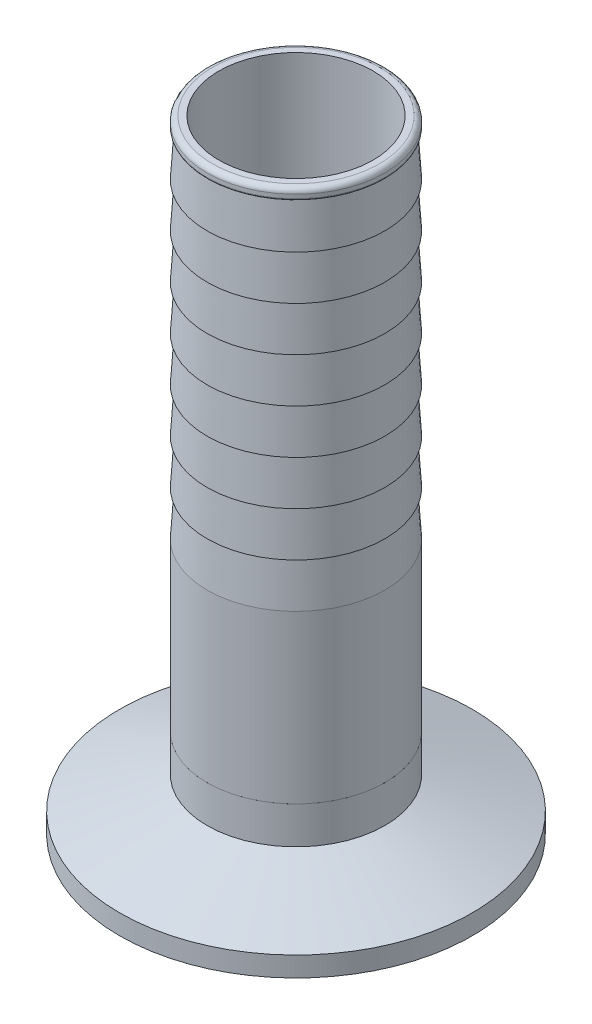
ISO-10303-21;
HEADER;
FILE_DESCRIPTION(('STEP AP214'),'2;1');
FILE_NAME('part.step','',(''),(''),'','','');
FILE_SCHEMA(('AUTOMOTIVE_DESIGN { 1 0 10303 214 1 1 1 1 }'));
ENDSEC;
DATA;
#1=APPLICATION_CONTEXT('core data for automotive mechanical design processes');
#2=APPLICATION_PROTOCOL_DEFINITION('international standard','automotive_design',2000,#1);
#3=PRODUCT_CONTEXT('',#1,'mechanical');
#4=PRODUCT('Part','Part','',(#3));
#5=PRODUCT_RELATED_PRODUCT_CATEGORY('part','',(#4));
#6=PRODUCT_DEFINITION_FORMATION('','',#4);
#7=PRODUCT_DEFINITION_CONTEXT('part definition',#1,'design');
#8=PRODUCT_DEFINITION('design','',#6,#7);
#9=PRODUCT_DEFINITION_SHAPE('','',#8);
#10=(LENGTH_UNIT() NAMED_UNIT(*) SI_UNIT(.MILLI.,.METRE.));
#11=(NAMED_UNIT(*) PLANE_ANGLE_UNIT() SI_UNIT($,.RADIAN.));
#12=(NAMED_UNIT(*) SI_UNIT($,.STERADIAN.) SOLID_ANGLE_UNIT());
#13=UNCERTAINTY_MEASURE_WITH_UNIT(LENGTH_MEASURE(1.E-05),#10,'distance_accuracy_value','');
#14=(GEOMETRIC_REPRESENTATION_CONTEXT(3) GLOBAL_UNCERTAINTY_ASSIGNED_CONTEXT((#13)) GLOBAL_UNIT_ASSIGNED_CONTEXT((#10,
#11,#12)) REPRESENTATION_CONTEXT('',''));
#15=CARTESIAN_POINT('',(0.,0.,0.));
#16=DIRECTION('',(0.,0.,1.));
#17=DIRECTION('',(1.,0.,0.));
#18=AXIS2_PLACEMENT_3D('',#15,#16,#17);
#19=CARTESIAN_POINT('',(36.2305462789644,30.890391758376,34.8496702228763));
#20=DIRECTION('',(0.,-1.,0.));
#21=DIRECTION('',(-0.475769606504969,0.,-0.879569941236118));
#22=AXIS2_PLACEMENT_3D('',#19,#20,#21);
#23=PLANE('',#22);
#24=CARTESIAN_POINT('',(25.0600080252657,30.890391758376,40.8919442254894));
#25=DIRECTION('',(0.,-1.,0.));
#26=DIRECTION('',(-0.475769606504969,0.,-0.879569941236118));
#27=AXIS2_PLACEMENT_3D('',#24,#25,#26);
#28=CIRCLE('',#27,11.0297020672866);
#29=CARTESIAN_POINT('',(19.8124110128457,30.890391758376,31.1905498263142));
#30=VERTEX_POINT('',#29);
#31=EDGE_CURVE('P0_E85',#30,#30,#28,.T.);
#32=ORIENTED_EDGE('',*,*,#31,.F.);
#33=EDGE_LOOP('',(#32));
#34=FACE_BOUND('',#33,.T.);
#35=CARTESIAN_POINT('',(25.0600080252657,30.890391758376,40.8919442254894));
#36=DIRECTION('',(0.,-1.,0.));
#37=DIRECTION('',(-0.475769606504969,0.,-0.879569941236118));
#38=AXIS2_PLACEMENT_3D('',#35,#36,#37);
#39=CIRCLE('',#38,12.7);
#40=CARTESIAN_POINT('',(19.0177340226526,30.890391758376,29.7214059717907));
#41=VERTEX_POINT('',#40);
#42=EDGE_CURVE('P0_E9',#41,#41,#39,.T.);
#43=ORIENTED_EDGE('',*,*,#42,.T.);
#44=EDGE_LOOP('',(#43));
#45=FACE_BOUND('',#44,.T.);
#46=ADVANCED_FACE('P0_F14',(#34,#45),#23,.T.);
#47=CARTESIAN_POINT('',(25.0600080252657,30.890391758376,40.8919442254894));
#48=DIRECTION('',(0.,-1.,0.));
#49=DIRECTION('',(-0.475769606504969,0.,-0.879569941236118));
#50=AXIS2_PLACEMENT_3D('',#47,#48,#49);
#51=CYLINDRICAL_SURFACE('',#50,12.7);
#52=CARTESIAN_POINT('',(25.0600080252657,54.715591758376,40.8919442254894));
#53=DIRECTION('',(0.,-1.,0.));
#54=DIRECTION('',(-0.475769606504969,0.,-0.879569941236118));
#55=AXIS2_PLACEMENT_3D('',#52,#53,#54);
#56=CIRCLE('',#55,12.7);
#57=CARTESIAN_POINT('',(19.0177340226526,54.715591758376,29.7214059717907));
#58=VERTEX_POINT('',#57);
#59=EDGE_CURVE('P0_E20',#58,#58,#56,.T.);
#60=ORIENTED_EDGE('',*,*,#59,.T.);
#61=EDGE_LOOP('',(#60));
#62=FACE_BOUND('',#61,.T.);
#63=ORIENTED_EDGE('',*,*,#42,.F.);
#64=EDGE_LOOP('',(#63));
#65=FACE_BOUND('',#64,.T.);
#66=ADVANCED_FACE('P0_F101',(#62,#65),#51,.T.);
#67=CARTESIAN_POINT('',(25.0600080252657,54.715591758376,40.8919442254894));
#68=DIRECTION('',(0.,-1.,0.));
#69=DIRECTION('',(-0.475769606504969,0.,-0.879569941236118));
#70=AXIS2_PLACEMENT_3D('',#67,#68,#69);
#71=CONICAL_SURFACE('',#70,12.7,0.0599281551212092);
#72=CARTESIAN_POINT('',(25.0600080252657,61.065591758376,40.8919442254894));
#73=DIRECTION('',(0.,-1.,0.));
#74=DIRECTION('',(-0.475769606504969,0.,-0.879569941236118));
#75=AXIS2_PLACEMENT_3D('',#72,#73,#74);
#76=CIRCLE('',#75,12.319);
#77=CARTESIAN_POINT('',(19.199002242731,61.065591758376,30.0565221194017));
#78=VERTEX_POINT('',#77);
#79=EDGE_CURVE('P0_E24',#78,#78,#76,.T.);
#80=ORIENTED_EDGE('',*,*,#79,.T.);
#81=EDGE_LOOP('',(#80));
#82=FACE_BOUND('',#81,.T.);
#83=ORIENTED_EDGE('',*,*,#59,.F.);
#84=EDGE_LOOP('',(#83));
#85=FACE_BOUND('',#84,.T.);
#86=ADVANCED_FACE('P0_F106',(#82,#85),#71,.T.);
#87=CARTESIAN_POINT('',(36.2305462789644,61.0655917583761,34.8496702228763));
#88=DIRECTION('',(0.,-1.,0.));
#89=DIRECTION('',(-0.475769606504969,0.,-0.879569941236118));
#90=AXIS2_PLACEMENT_3D('',#87,#88,#89);
#91=PLANE('',#90);
#92=CARTESIAN_POINT('',(25.0600080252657,61.065591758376,40.8919442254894));
#93=DIRECTION('',(0.,-1.,0.));
#94=DIRECTION('',(-0.475769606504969,0.,-0.879569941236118));
#95=AXIS2_PLACEMENT_3D('',#92,#93,#94);
#96=CIRCLE('',#95,12.7);
#97=CARTESIAN_POINT('',(19.0177340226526,61.065591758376,29.7214059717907));
#98=VERTEX_POINT('',#97);
#99=EDGE_CURVE('P0_E28',#98,#98,#96,.T.);
#100=ORIENTED_EDGE('',*,*,#99,.T.);
#101=EDGE_LOOP('',(#100));
#102=FACE_BOUND('',#101,.T.);
#103=ORIENTED_EDGE('',*,*,#79,.F.);
#104=EDGE_LOOP('',(#103));
#105=FACE_BOUND('',#104,.T.);
#106=ADVANCED_FACE('P0_F110',(#102,#105),#91,.T.);
#107=CARTESIAN_POINT('',(25.0600080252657,61.065591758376,40.8919442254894));
#108=DIRECTION('',(0.,-1.,0.));
#109=DIRECTION('',(-0.475769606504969,0.,-0.879569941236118));
#110=AXIS2_PLACEMENT_3D('',#107,#108,#109);
#111=CONICAL_SURFACE('',#110,12.7,0.0599281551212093);
#112=CARTESIAN_POINT('',(25.0600080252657,67.415591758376,40.8919442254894));
#113=DIRECTION('',(0.,-1.,0.));
#114=DIRECTION('',(-0.475769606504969,0.,-0.879569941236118));
#115=AXIS2_PLACEMENT_3D('',#112,#113,#114);
#116=CIRCLE('',#115,12.319);
#117=CARTESIAN_POINT('',(19.199002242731,67.415591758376,30.0565221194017));
#118=VERTEX_POINT('',#117);
#119=EDGE_CURVE('P0_E33',#118,#118,#116,.T.);
#120=ORIENTED_EDGE('',*,*,#119,.T.);
#121=EDGE_LOOP('',(#120));
#122=FACE_BOUND('',#121,.T.);
#123=ORIENTED_EDGE('',*,*,#99,.F.);
#124=EDGE_LOOP('',(#123));
#125=FACE_BOUND('',#124,.T.);
#126=ADVANCED_FACE('P0_F117',(#122,#125),#111,.T.);
#127=CARTESIAN_POINT('',(36.2305462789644,67.4155917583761,34.8496702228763));
#128=DIRECTION('',(0.,-1.,0.));
#129=DIRECTION('',(-0.475769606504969,0.,-0.879569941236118));
#130=AXIS2_PLACEMENT_3D('',#127,#128,#129);
#131=PLANE('',#130);
#132=CARTESIAN_POINT('',(25.0600080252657,67.415591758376,40.8919442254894));
#133=DIRECTION('',(0.,-1.,0.));
#134=DIRECTION('',(-0.475769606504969,0.,-0.879569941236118));
#135=AXIS2_PLACEMENT_3D('',#132,#133,#134);
#136=CIRCLE('',#135,12.7);
#137=CARTESIAN_POINT('',(19.0177340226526,67.415591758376,29.7214059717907));
#138=VERTEX_POINT('',#137);
#139=EDGE_CURVE('P0_E36',#138,#138,#136,.T.);
#140=ORIENTED_EDGE('',*,*,#139,.T.);
#141=EDGE_LOOP('',(#140));
#142=FACE_BOUND('',#141,.T.);
#143=ORIENTED_EDGE('',*,*,#119,.F.);
#144=EDGE_LOOP('',(#143));
#145=FACE_BOUND('',#144,.T.);
#146=ADVANCED_FACE('P0_F121',(#142,#145),#131,.T.);
#147=CARTESIAN_POINT('',(25.0600080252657,67.415591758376,40.8919442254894));
#148=DIRECTION('',(0.,-1.,0.));
#149=DIRECTION('',(-0.475769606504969,0.,-0.879569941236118));
#150=AXIS2_PLACEMENT_3D('',#147,#148,#149);
#151=CONICAL_SURFACE('',#150,12.7,0.0599281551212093);
#152=CARTESIAN_POINT('',(25.0600080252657,73.765591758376,40.8919442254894));
#153=DIRECTION('',(0.,-1.,0.));
#154=DIRECTION('',(-0.475769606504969,0.,-0.879569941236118));
#155=AXIS2_PLACEMENT_3D('',#152,#153,#154);
#156=CIRCLE('',#155,12.319);
#157=CARTESIAN_POINT('',(19.199002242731,73.765591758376,30.0565221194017));
#158=VERTEX_POINT('',#157);
#159=EDGE_CURVE('P0_E39',#158,#158,#156,.T.);
#160=ORIENTED_EDGE('',*,*,#159,.T.);
#161=EDGE_LOOP('',(#160));
#162=FACE_BOUND('',#161,.T.);
#163=ORIENTED_EDGE('',*,*,#139,.F.);
#164=EDGE_LOOP('',(#163));
#165=FACE_BOUND('',#164,.T.);
#166=ADVANCED_FACE('P0_F125',(#162,#165),#151,.T.);
#167=CARTESIAN_POINT('',(36.2305462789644,73.7655917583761,34.8496702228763));
#168=DIRECTION('',(0.,-1.,0.));
#169=DIRECTION('',(-0.475769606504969,0.,-0.879569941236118));
#170=AXIS2_PLACEMENT_3D('',#167,#168,#169);
#171=PLANE('',#170);
#172=CARTESIAN_POINT('',(25.0600080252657,73.765591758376,40.8919442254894));
#173=DIRECTION('',(0.,-1.,0.));
#174=DIRECTION('',(-0.475769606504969,0.,-0.879569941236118));
#175=AXIS2_PLACEMENT_3D('',#172,#173,#174);
#176=CIRCLE('',#175,12.7);
#177=CARTESIAN_POINT('',(19.0177340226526,73.765591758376,29.7214059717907));
#178=VERTEX_POINT('',#177);
#179=EDGE_CURVE('P0_E42',#178,#178,#176,.T.);
#180=ORIENTED_EDGE('',*,*,#179,.T.);
#181=EDGE_LOOP('',(#180));
#182=FACE_BOUND('',#181,.T.);
#183=ORIENTED_EDGE('',*,*,#159,.F.);
#184=EDGE_LOOP('',(#183));
#185=FACE_BOUND('',#184,.T.);
#186=ADVANCED_FACE('P0_F129',(#182,#185),#171,.T.);
#187=CARTESIAN_POINT('',(25.0600080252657,73.765591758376,40.8919442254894));
#188=DIRECTION('',(0.,-1.,0.));
#189=DIRECTION('',(-0.475769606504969,0.,-0.879569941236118));
#190=AXIS2_PLACEMENT_3D('',#187,#188,#189);
#191=CONICAL_SURFACE('',#190,12.7,0.0599281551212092);
#192=CARTESIAN_POINT('',(25.0600080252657,80.115591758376,40.8919442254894));
#193=DIRECTION('',(0.,-1.,0.));
#194=DIRECTION('',(-0.475769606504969,0.,-0.879569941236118));
#195=AXIS2_PLACEMENT_3D('',#192,#193,#194);
#196=CIRCLE('',#195,12.319);
#197=CARTESIAN_POINT('',(19.199002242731,80.115591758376,30.0565221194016));
#198=VERTEX_POINT('',#197);
#199=EDGE_CURVE('P0_E45',#198,#198,#196,.T.);
#200=ORIENTED_EDGE('',*,*,#199,.T.);
#201=EDGE_LOOP('',(#200));
#202=FACE_BOUND('',#201,.T.);
#203=ORIENTED_EDGE('',*,*,#179,.F.);
#204=EDGE_LOOP('',(#203));
#205=FACE_BOUND('',#204,.T.);
#206=ADVANCED_FACE('P0_F133',(#202,#205),#191,.T.);
#207=CARTESIAN_POINT('',(36.2305462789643,80.1155917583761,34.8496702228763));
#208=DIRECTION('',(0.,-1.,0.));
#209=DIRECTION('',(-0.475769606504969,0.,-0.879569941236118));
#210=AXIS2_PLACEMENT_3D('',#207,#208,#209);
#211=PLANE('',#210);
#212=CARTESIAN_POINT('',(25.0600080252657,80.115591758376,40.8919442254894));
#213=DIRECTION('',(0.,-1.,0.));
#214=DIRECTION('',(-0.475769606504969,0.,-0.879569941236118));
#215=AXIS2_PLACEMENT_3D('',#212,#213,#214);
#216=CIRCLE('',#215,12.7);
#217=CARTESIAN_POINT('',(19.0177340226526,80.115591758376,29.7214059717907));
#218=VERTEX_POINT('',#217);
#219=EDGE_CURVE('P0_E48',#218,#218,#216,.T.);
#220=ORIENTED_EDGE('',*,*,#219,.T.);
#221=EDGE_LOOP('',(#220));
#222=FACE_BOUND('',#221,.T.);
#223=ORIENTED_EDGE('',*,*,#199,.F.);
#224=EDGE_LOOP('',(#223));
#225=FACE_BOUND('',#224,.T.);
#226=ADVANCED_FACE('P0_F137',(#222,#225),#211,.T.);
#227=CARTESIAN_POINT('',(25.0600080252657,80.115591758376,40.8919442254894));
#228=DIRECTION('',(0.,-1.,0.));
#229=DIRECTION('',(-0.475769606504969,0.,-0.879569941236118));
#230=AXIS2_PLACEMENT_3D('',#227,#228,#229);
#231=CONICAL_SURFACE('',#230,12.7,0.0599281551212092);
#232=CARTESIAN_POINT('',(25.0600080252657,86.465591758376,40.8919442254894));
#233=DIRECTION('',(0.,-1.,0.));
#234=DIRECTION('',(-0.475769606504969,0.,-0.879569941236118));
#235=AXIS2_PLACEMENT_3D('',#232,#233,#234);
#236=CIRCLE('',#235,12.319);
#237=CARTESIAN_POINT('',(19.199002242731,86.465591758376,30.0565221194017));
#238=VERTEX_POINT('',#237);
#239=EDGE_CURVE('P0_E51',#238,#238,#236,.T.);
#240=ORIENTED_EDGE('',*,*,#239,.T.);
#241=EDGE_LOOP('',(#240));
#242=FACE_BOUND('',#241,.T.);
#243=ORIENTED_EDGE('',*,*,#219,.F.);
#244=EDGE_LOOP('',(#243));
#245=FACE_BOUND('',#244,.T.);
#246=ADVANCED_FACE('P0_F141',(#242,#245),#231,.T.);
#247=CARTESIAN_POINT('',(36.2305462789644,86.4655917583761,34.8496702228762));
#248=DIRECTION('',(0.,-1.,0.));
#249=DIRECTION('',(-0.475769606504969,0.,-0.879569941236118));
#250=AXIS2_PLACEMENT_3D('',#247,#248,#249);
#251=PLANE('',#250);
#252=CARTESIAN_POINT('',(25.0600080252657,86.465591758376,40.8919442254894));
#253=DIRECTION('',(0.,-1.,0.));
#254=DIRECTION('',(-0.475769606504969,0.,-0.879569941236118));
#255=AXIS2_PLACEMENT_3D('',#252,#253,#254);
#256=CIRCLE('',#255,12.7);
#257=CARTESIAN_POINT('',(19.0177340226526,86.465591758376,29.7214059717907));
#258=VERTEX_POINT('',#257);
#259=EDGE_CURVE('P0_E54',#258,#258,#256,.T.);
#260=ORIENTED_EDGE('',*,*,#259,.T.);
#261=EDGE_LOOP('',(#260));
#262=FACE_BOUND('',#261,.T.);
#263=ORIENTED_EDGE('',*,*,#239,.F.);
#264=EDGE_LOOP('',(#263));
#265=FACE_BOUND('',#264,.T.);
#266=ADVANCED_FACE('P0_F145',(#262,#265),#251,.T.);
#267=CARTESIAN_POINT('',(25.0600080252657,86.465591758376,40.8919442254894));
#268=DIRECTION('',(0.,-1.,0.));
#269=DIRECTION('',(-0.475769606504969,0.,-0.879569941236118));
#270=AXIS2_PLACEMENT_3D('',#267,#268,#269);
#271=CONICAL_SURFACE('',#270,12.7,0.0599281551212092);
#272=CARTESIAN_POINT('',(25.0600080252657,92.815591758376,40.8919442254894));
#273=DIRECTION('',(0.,-1.,0.));
#274=DIRECTION('',(-0.475769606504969,0.,-0.879569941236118));
#275=AXIS2_PLACEMENT_3D('',#272,#273,#274);
#276=CIRCLE('',#275,12.319);
#277=CARTESIAN_POINT('',(19.199002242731,92.815591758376,30.0565221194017));
#278=VERTEX_POINT('',#277);
#279=EDGE_CURVE('P0_E57',#278,#278,#276,.T.);
#280=ORIENTED_EDGE('',*,*,#279,.T.);
#281=EDGE_LOOP('',(#280));
#282=FACE_BOUND('',#281,.T.);
#283=ORIENTED_EDGE('',*,*,#259,.F.);
#284=EDGE_LOOP('',(#283));
#285=FACE_BOUND('',#284,.T.);
#286=ADVANCED_FACE('P0_F149',(#282,#285),#271,.T.);
#287=CARTESIAN_POINT('',(36.2305462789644,92.8155917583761,34.8496702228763));
#288=DIRECTION('',(0.,-1.,0.));
#289=DIRECTION('',(-0.475769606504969,0.,-0.879569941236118));
#290=AXIS2_PLACEMENT_3D('',#287,#288,#289);
#291=PLANE('',#290);
#292=CARTESIAN_POINT('',(25.0600080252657,92.815591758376,40.8919442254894));
#293=DIRECTION('',(0.,-1.,0.));
#294=DIRECTION('',(-0.475769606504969,0.,-0.879569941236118));
#295=AXIS2_PLACEMENT_3D('',#292,#293,#294);
#296=CIRCLE('',#295,12.7);
#297=CARTESIAN_POINT('',(19.0177340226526,92.815591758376,29.7214059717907));
#298=VERTEX_POINT('',#297);
#299=EDGE_CURVE('P0_E60',#298,#298,#296,.T.);
#300=ORIENTED_EDGE('',*,*,#299,.T.);
#301=EDGE_LOOP('',(#300));
#302=FACE_BOUND('',#301,.T.);
#303=ORIENTED_EDGE('',*,*,#279,.F.);
#304=EDGE_LOOP('',(#303));
#305=FACE_BOUND('',#304,.T.);
#306=ADVANCED_FACE('P0_F153',(#302,#305),#291,.T.);
#307=CARTESIAN_POINT('',(25.0600080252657,92.815591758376,40.8919442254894));
#308=DIRECTION('',(0.,-1.,0.));
#309=DIRECTION('',(-0.475769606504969,0.,-0.879569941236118));
#310=AXIS2_PLACEMENT_3D('',#307,#308,#309);
#311=CONICAL_SURFACE('',#310,12.7,0.0599281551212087);
#312=CARTESIAN_POINT('',(25.0600080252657,99.165591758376,40.8919442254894));
#313=DIRECTION('',(0.,-1.,0.));
#314=DIRECTION('',(-0.475769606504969,0.,-0.879569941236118));
#315=AXIS2_PLACEMENT_3D('',#312,#313,#314);
#316=CIRCLE('',#315,12.319);
#317=CARTESIAN_POINT('',(19.199002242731,99.165591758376,30.0565221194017));
#318=VERTEX_POINT('',#317);
#319=EDGE_CURVE('P0_E63',#318,#318,#316,.T.);
#320=ORIENTED_EDGE('',*,*,#319,.T.);
#321=EDGE_LOOP('',(#320));
#322=FACE_BOUND('',#321,.T.);
#323=ORIENTED_EDGE('',*,*,#299,.F.);
#324=EDGE_LOOP('',(#323));
#325=FACE_BOUND('',#324,.T.);
#326=ADVANCED_FACE('P0_F157',(#322,#325),#311,.T.);
#327=CARTESIAN_POINT('',(36.2305462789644,99.165591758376,34.8496702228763));
#328=DIRECTION('',(0.,-1.,0.));
#329=DIRECTION('',(-0.475769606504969,0.,-0.879569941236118));
#330=AXIS2_PLACEMENT_3D('',#327,#328,#329);
#331=PLANE('',#330);
#332=CARTESIAN_POINT('',(25.0600080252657,99.165591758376,40.8919442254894));
#333=DIRECTION('',(0.,-1.,0.));
#334=DIRECTION('',(-0.475769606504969,0.,-0.879569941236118));
#335=AXIS2_PLACEMENT_3D('',#332,#333,#334);
#336=CIRCLE('',#335,12.7);
#337=CARTESIAN_POINT('',(19.0177340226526,99.165591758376,29.7214059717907));
#338=VERTEX_POINT('',#337);
#339=EDGE_CURVE('P0_E66',#338,#338,#336,.T.);
#340=ORIENTED_EDGE('',*,*,#339,.T.);
#341=EDGE_LOOP('',(#340));
#342=FACE_BOUND('',#341,.T.);
#343=ORIENTED_EDGE('',*,*,#319,.F.);
#344=EDGE_LOOP('',(#343));
#345=FACE_BOUND('',#344,.T.);
#346=ADVANCED_FACE('P0_F161',(#342,#345),#331,.T.);
#347=CARTESIAN_POINT('',(25.0600080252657,99.165591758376,40.8919442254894));
#348=DIRECTION('',(0.,-1.,0.));
#349=DIRECTION('',(-0.475769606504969,0.,-0.879569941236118));
#350=AXIS2_PLACEMENT_3D('',#347,#348,#349);
#351=CONICAL_SURFACE('',#350,12.7,0.0599281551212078);
#352=CARTESIAN_POINT('',(25.0600080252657,105.515591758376,40.8919442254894));
#353=DIRECTION('',(0.,-1.,0.));
#354=DIRECTION('',(-0.475769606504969,0.,-0.879569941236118));
#355=AXIS2_PLACEMENT_3D('',#352,#353,#354);
#356=CIRCLE('',#355,12.319);
#357=CARTESIAN_POINT('',(19.199002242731,105.515591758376,30.0565221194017));
#358=VERTEX_POINT('',#357);
#359=EDGE_CURVE('P0_E69',#358,#358,#356,.T.);
#360=ORIENTED_EDGE('',*,*,#359,.T.);
#361=EDGE_LOOP('',(#360));
#362=FACE_BOUND('',#361,.T.);
#363=ORIENTED_EDGE('',*,*,#339,.F.);
#364=EDGE_LOOP('',(#363));
#365=FACE_BOUND('',#364,.T.);
#366=ADVANCED_FACE('P0_F165',(#362,#365),#351,.T.);
#367=CARTESIAN_POINT('',(36.0071355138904,105.515591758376,34.9705157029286));
#368=DIRECTION('',(0.,-1.,0.));
#369=DIRECTION('',(-0.475769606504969,0.,-0.879569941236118));
#370=AXIS2_PLACEMENT_3D('',#367,#368,#369);
#371=PLANE('',#370);
#372=CARTESIAN_POINT('',(25.0600080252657,105.515591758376,40.8919442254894));
#373=DIRECTION('',(0.,-1.,0.));
#374=DIRECTION('',(-0.475769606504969,0.,-0.879569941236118));
#375=AXIS2_PLACEMENT_3D('',#372,#373,#374);
#376=CIRCLE('',#375,12.446);
#377=CARTESIAN_POINT('',(19.1385795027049,105.515591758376,29.9448167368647));
#378=VERTEX_POINT('',#377);
#379=EDGE_CURVE('P0_E72',#378,#378,#376,.T.);
#380=ORIENTED_EDGE('',*,*,#379,.T.);
#381=EDGE_LOOP('',(#380));
#382=FACE_BOUND('',#381,.T.);
#383=ORIENTED_EDGE('',*,*,#359,.F.);
#384=EDGE_LOOP('',(#383));
#385=FACE_BOUND('',#384,.T.);
#386=ADVANCED_FACE('P0_F169',(#382,#385),#371,.T.);
#387=CARTESIAN_POINT('',(25.0600080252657,105.769591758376,40.8919442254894));
#388=DIRECTION('',(0.,-1.,0.));
#389=DIRECTION('',(-0.475769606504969,0.,-0.879569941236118));
#390=AXIS2_PLACEMENT_3D('',#387,#388,#389);
#391=TOROIDAL_SURFACE('',#390,12.446,0.254000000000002);
#392=CARTESIAN_POINT('',(25.0600080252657,105.769591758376,40.8919442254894));
#393=DIRECTION('',(0.,-1.,0.));
#394=DIRECTION('',(-0.475769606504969,0.,-0.879569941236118));
#395=AXIS2_PLACEMENT_3D('',#392,#393,#394);
#396=CIRCLE('',#395,12.7);
#397=CARTESIAN_POINT('',(19.0177340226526,105.769591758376,29.7214059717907));
#398=VERTEX_POINT('',#397);
#399=EDGE_CURVE('P0_E75',#398,#398,#396,.T.);
#400=ORIENTED_EDGE('',*,*,#399,.T.);
#401=EDGE_LOOP('',(#400));
#402=FACE_BOUND('',#401,.T.);
#403=ORIENTED_EDGE('',*,*,#379,.F.);
#404=EDGE_LOOP('',(#403));
#405=FACE_BOUND('',#404,.T.);
#406=ADVANCED_FACE('P0_F173',(#402,#405),#391,.T.);
#407=CARTESIAN_POINT('',(25.0600080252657,30.890391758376,40.8919442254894));
#408=DIRECTION('',(0.,-1.,0.));
#409=DIRECTION('',(-0.475769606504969,0.,-0.879569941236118));
#410=AXIS2_PLACEMENT_3D('',#407,#408,#409);
#411=CYLINDRICAL_SURFACE('',#410,12.7);
#412=CARTESIAN_POINT('',(25.0600080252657,106.328391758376,40.8919442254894));
#413=DIRECTION('',(0.,-1.,0.));
#414=DIRECTION('',(-0.475769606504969,0.,-0.879569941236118));
#415=AXIS2_PLACEMENT_3D('',#412,#413,#414);
#416=CIRCLE('',#415,12.7);
#417=CARTESIAN_POINT('',(19.0177340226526,106.328391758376,29.7214059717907));
#418=VERTEX_POINT('',#417);
#419=EDGE_CURVE('P0_E78',#418,#418,#416,.T.);
#420=ORIENTED_EDGE('',*,*,#419,.T.);
#421=EDGE_LOOP('',(#420));
#422=FACE_BOUND('',#421,.T.);
#423=ORIENTED_EDGE('',*,*,#399,.F.);
#424=EDGE_LOOP('',(#423));
#425=FACE_BOUND('',#424,.T.);
#426=ADVANCED_FACE('P0_F177',(#422,#425),#411,.T.);
#427=CARTESIAN_POINT('',(25.0600080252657,106.328391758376,40.8919442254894));
#428=DIRECTION('',(0.,-1.,0.));
#429=DIRECTION('',(-0.475769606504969,0.,-0.879569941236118));
#430=AXIS2_PLACEMENT_3D('',#427,#428,#429);
#431=TOROIDAL_SURFACE('',#430,11.938,0.762);
#432=CARTESIAN_POINT('',(25.0600080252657,107.090391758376,40.8919442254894));
#433=DIRECTION('',(0.,-1.,0.));
#434=DIRECTION('',(-0.475769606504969,0.,-0.879569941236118));
#435=AXIS2_PLACEMENT_3D('',#432,#433,#434);
#436=CIRCLE('',#435,11.938);
#437=CARTESIAN_POINT('',(19.3802704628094,107.090391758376,30.3916382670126));
#438=VERTEX_POINT('',#437);
#439=EDGE_CURVE('P0_E81',#438,#438,#436,.T.);
#440=ORIENTED_EDGE('',*,*,#439,.T.);
#441=EDGE_LOOP('',(#440));
#442=FACE_BOUND('',#441,.T.);
#443=ORIENTED_EDGE('',*,*,#419,.F.);
#444=EDGE_LOOP('',(#443));
#445=FACE_BOUND('',#444,.T.);
#446=ADVANCED_FACE('P0_F181',(#442,#445),#431,.T.);
#447=CARTESIAN_POINT('',(25.0600080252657,107.090391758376,40.8919442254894));
#448=DIRECTION('',(0.,1.,0.));
#449=DIRECTION('',(0.475769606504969,0.,0.879569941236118));
#450=AXIS2_PLACEMENT_3D('',#447,#448,#449);
#451=PLANE('',#450);
#452=CARTESIAN_POINT('',(25.0600080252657,107.090391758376,40.8919442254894));
#453=DIRECTION('',(0.,-1.,0.));
#454=DIRECTION('',(-0.475769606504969,0.,-0.879569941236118));
#455=AXIS2_PLACEMENT_3D('',#452,#453,#454);
#456=CIRCLE('',#455,11.0297020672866);
#457=CARTESIAN_POINT('',(19.8124110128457,107.090391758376,31.1905498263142));
#458=VERTEX_POINT('',#457);
#459=EDGE_CURVE('P0_E84',#458,#458,#456,.T.);
#460=ORIENTED_EDGE('',*,*,#459,.T.);
#461=EDGE_LOOP('',(#460));
#462=FACE_BOUND('',#461,.T.);
#463=ORIENTED_EDGE('',*,*,#439,.F.);
#464=EDGE_LOOP('',(#463));
#465=FACE_BOUND('',#464,.T.);
#466=ADVANCED_FACE('P0_F91',(#462,#465),#451,.T.);
#467=CARTESIAN_POINT('',(25.0600080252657,107.090391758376,40.8919442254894));
#468=DIRECTION('',(0.,-1.,0.));
#469=DIRECTION('',(-0.475769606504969,0.,-0.879569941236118));
#470=AXIS2_PLACEMENT_3D('',#467,#468,#469);
#471=CYLINDRICAL_SURFACE('',#470,11.0297020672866);
#472=CARTESIAN_POINT('',(19.8124110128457,107.090391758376,31.1905498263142));
#473=CARTESIAN_POINT('',(19.8124110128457,106.296641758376,31.1905498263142));
#474=CARTESIAN_POINT('',(19.8124110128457,105.502891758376,31.1905498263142));
#475=CARTESIAN_POINT('',(19.8124110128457,103.915391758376,31.1905498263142));
#476=CARTESIAN_POINT('',(19.8124110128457,103.121641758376,31.1905498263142));
#477=CARTESIAN_POINT('',(19.8124110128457,101.534141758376,31.1905498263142));
#478=CARTESIAN_POINT('',(19.8124110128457,100.740391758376,31.1905498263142));
#479=CARTESIAN_POINT('',(19.8124110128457,99.152891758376,31.1905498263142));
#480=CARTESIAN_POINT('',(19.8124110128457,98.359141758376,31.1905498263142));
#481=CARTESIAN_POINT('',(19.8124110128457,96.771641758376,31.1905498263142));
#482=CARTESIAN_POINT('',(19.8124110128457,95.977891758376,31.1905498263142));
#483=CARTESIAN_POINT('',(19.8124110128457,94.390391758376,31.1905498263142));
#484=CARTESIAN_POINT('',(19.8124110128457,93.596641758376,31.1905498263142));
#485=CARTESIAN_POINT('',(19.8124110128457,92.009141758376,31.1905498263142));
#486=CARTESIAN_POINT('',(19.8124110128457,91.215391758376,31.1905498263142));
#487=CARTESIAN_POINT('',(19.8124110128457,89.627891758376,31.1905498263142));
#488=CARTESIAN_POINT('',(19.8124110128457,88.834141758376,31.1905498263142));
#489=CARTESIAN_POINT('',(19.8124110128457,87.246641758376,31.1905498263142));
#490=CARTESIAN_POINT('',(19.8124110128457,86.452891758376,31.1905498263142));
#491=CARTESIAN_POINT('',(19.8124110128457,84.865391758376,31.1905498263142));
#492=CARTESIAN_POINT('',(19.8124110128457,84.071641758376,31.1905498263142));
#493=CARTESIAN_POINT('',(19.8124110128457,82.484141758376,31.1905498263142));
#494=CARTESIAN_POINT('',(19.8124110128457,81.690391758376,31.1905498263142));
#495=CARTESIAN_POINT('',(19.8124110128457,80.102891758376,31.1905498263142));
#496=CARTESIAN_POINT('',(19.8124110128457,79.309141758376,31.1905498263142));
#497=CARTESIAN_POINT('',(19.8124110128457,77.721641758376,31.1905498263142));
#498=CARTESIAN_POINT('',(19.8124110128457,76.927891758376,31.1905498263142));
#499=CARTESIAN_POINT('',(19.8124110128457,75.340391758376,31.1905498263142));
#500=CARTESIAN_POINT('',(19.8124110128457,74.546641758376,31.1905498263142));
#501=CARTESIAN_POINT('',(19.8124110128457,72.959141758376,31.1905498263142));
#502=CARTESIAN_POINT('',(19.8124110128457,72.165391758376,31.1905498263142));
#503=CARTESIAN_POINT('',(19.8124110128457,70.577891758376,31.1905498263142));
#504=CARTESIAN_POINT('',(19.8124110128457,69.784141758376,31.1905498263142));
#505=CARTESIAN_POINT('',(19.8124110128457,68.196641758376,31.1905498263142));
#506=CARTESIAN_POINT('',(19.8124110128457,67.402891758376,31.1905498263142));
#507=CARTESIAN_POINT('',(19.8124110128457,65.815391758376,31.1905498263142));
#508=CARTESIAN_POINT('',(19.8124110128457,65.021641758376,31.1905498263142));
#509=CARTESIAN_POINT('',(19.8124110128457,63.434141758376,31.1905498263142));
#510=CARTESIAN_POINT('',(19.8124110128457,62.640391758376,31.1905498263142));
#511=CARTESIAN_POINT('',(19.8124110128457,61.052891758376,31.1905498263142));
#512=CARTESIAN_POINT('',(19.8124110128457,60.259141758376,31.1905498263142));
#513=CARTESIAN_POINT('',(19.8124110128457,58.671641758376,31.1905498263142));
#514=CARTESIAN_POINT('',(19.8124110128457,57.877891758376,31.1905498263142));
#515=CARTESIAN_POINT('',(19.8124110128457,56.290391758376,31.1905498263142));
#516=CARTESIAN_POINT('',(19.8124110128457,55.496641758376,31.1905498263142));
#517=CARTESIAN_POINT('',(19.8124110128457,53.909141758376,31.1905498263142));
#518=CARTESIAN_POINT('',(19.8124110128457,53.115391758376,31.1905498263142));
#519=CARTESIAN_POINT('',(19.8124110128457,51.527891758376,31.1905498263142));
#520=CARTESIAN_POINT('',(19.8124110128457,50.734141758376,31.1905498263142));
#521=CARTESIAN_POINT('',(19.8124110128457,49.146641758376,31.1905498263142));
#522=CARTESIAN_POINT('',(19.8124110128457,48.352891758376,31.1905498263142));
#523=CARTESIAN_POINT('',(19.8124110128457,46.765391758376,31.1905498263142));
#524=CARTESIAN_POINT('',(19.8124110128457,45.971641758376,31.1905498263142));
#525=CARTESIAN_POINT('',(19.8124110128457,44.384141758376,31.1905498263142));
#526=CARTESIAN_POINT('',(19.8124110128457,43.5903917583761,31.1905498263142));
#527=CARTESIAN_POINT('',(19.8124110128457,42.0028917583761,31.1905498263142));
#528=CARTESIAN_POINT('',(19.8124110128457,41.2091417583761,31.1905498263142));
#529=CARTESIAN_POINT('',(19.8124110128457,39.6216417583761,31.1905498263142));
#530=CARTESIAN_POINT('',(19.8124110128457,38.8278917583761,31.1905498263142));
#531=CARTESIAN_POINT('',(19.8124110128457,37.240391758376,31.1905498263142));
#532=CARTESIAN_POINT('',(19.8124110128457,36.4466417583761,31.1905498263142));
#533=CARTESIAN_POINT('',(19.8124110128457,34.859141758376,31.1905498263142));
#534=CARTESIAN_POINT('',(19.8124110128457,34.0653917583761,31.1905498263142));
#535=CARTESIAN_POINT('',(19.8124110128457,32.477891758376,31.1905498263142));
#536=CARTESIAN_POINT('',(19.8124110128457,31.684141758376,31.1905498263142));
#537=CARTESIAN_POINT('',(19.8124110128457,30.890391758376,31.1905498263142));
#538=B_SPLINE_CURVE_WITH_KNOTS('',3,(#472,#473,#474,#475,#476,#477,#478,#479,#480,#481,#482,
#483,#484,#485,#486,#487,#488,#489,#490,#491,#492,#493,#494,#495,#496,#497,#498,#499,#500,#501,
#502,#503,#504,#505,#506,#507,#508,#509,#510,#511,#512,#513,#514,#515,#516,#517,#518,#519,#520,
#521,#522,#523,#524,#525,#526,#527,#528,#529,#530,#531,#532,#533,#534,#535,#536,#537),
.UNSPECIFIED.,.F.,.F.,(4,2,2,2,2,2,2,2,2,2,2,2,2,2,2,2,2,2,2,2,2,2,2,2,2,2,2,2,2,2,2,2,4),(0.,
2.38125,4.7625,7.14375,9.52500000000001,11.90625,14.2875,16.66875,19.05,21.43125,23.8125,
26.19375,28.575,30.95625,33.3375,35.71875,38.1,40.48125,42.8625,45.24375,47.625,50.00625,
52.3875,54.76875,57.15,59.53125,61.9125,64.29375,66.675,69.05625,71.4375,73.81875,76.2),.UNSPECIFIED.);
#539=EDGE_CURVE('P0_BSEAM94',#458,#30,#538,.T.);
#540=ORIENTED_EDGE('',*,*,#459,.F.);
#541=ORIENTED_EDGE('',*,*,#31,.T.);
#542=ORIENTED_EDGE('',*,*,#539,.T.);
#543=ORIENTED_EDGE('',*,*,#539,.F.);
#544=EDGE_LOOP('',(#540,#542,#541,#543));
#545=FACE_BOUND('',#544,.T.);
#546=ADVANCED_FACE('P0_F94',(#545),#471,.F.);
#547=CLOSED_SHELL('',(#46,#66,#86,#106,#126,#146,#166,#186,#206,#226,#246,#266,#286,#306,#326,
#346,#366,#386,#406,#426,#446,#466,#546));
#548=MANIFOLD_SOLID_BREP('P0_B1',#547);
#549=CARTESIAN_POINT('',(25.0600080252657,18.977791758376,40.8919442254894));
#550=DIRECTION('',(0.,-1.,0.));
#551=DIRECTION('',(0.,0.,-1.));
#552=AXIS2_PLACEMENT_3D('',#549,#550,#551);
#553=TOROIDAL_SURFACE('',#552,23.6366084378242,0.787399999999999);
#554=CARTESIAN_POINT('',(25.0600080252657,18.190391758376,40.8919442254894));
#555=DIRECTION('',(0.,-1.,0.));
#556=DIRECTION('',(0.,0.,-1.));
#557=AXIS2_PLACEMENT_3D('',#554,#555,#556);
#558=CIRCLE('',#557,23.6366084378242);
#559=CARTESIAN_POINT('',(25.0600080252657,18.190391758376,17.2553357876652));
#560=VERTEX_POINT('',#559);
#561=EDGE_CURVE('P1_E49',#560,#560,#558,.T.);
#562=ORIENTED_EDGE('',*,*,#561,.T.);
#563=EDGE_LOOP('',(#562));
#564=FACE_BOUND('',#563,.T.);
#565=CARTESIAN_POINT('',(25.0600080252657,18.664850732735,40.8919442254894));
#566=DIRECTION('',(0.,-1.,0.));
#567=DIRECTION('',(0.,0.,-1.));
#568=AXIS2_PLACEMENT_3D('',#565,#566,#567);
#569=CIRCLE('',#568,22.9140666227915);
#570=CARTESIAN_POINT('',(25.0600080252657,18.664850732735,17.9778776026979));
#571=VERTEX_POINT('',#570);
#572=EDGE_CURVE('P1_E10',#571,#571,#569,.T.);
#573=ORIENTED_EDGE('',*,*,#572,.F.);
#574=EDGE_LOOP('',(#573));
#575=FACE_BOUND('',#574,.T.);
#576=ADVANCED_FACE('P1_F15',(#564,#575),#553,.T.);
#577=CARTESIAN_POINT('',(25.0600080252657,18.190391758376,40.8919442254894));
#578=DIRECTION('',(0.,-1.,0.));
#579=DIRECTION('',(0.,0.,-1.));
#580=AXIS2_PLACEMENT_3D('',#577,#578,#579);
#581=TOROIDAL_SURFACE('',#580,21.8186,1.1938);
#582=CARTESIAN_POINT('',(25.0600080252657,18.664850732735,40.8919442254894));
#583=DIRECTION('',(0.,-1.,0.));
#584=DIRECTION('',(0.,0.,-1.));
#585=AXIS2_PLACEMENT_3D('',#582,#583,#584);
#586=CIRCLE('',#585,20.7231333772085);
#587=CARTESIAN_POINT('',(25.0600080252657,18.664850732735,20.1688108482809));
#588=VERTEX_POINT('',#587);
#589=EDGE_CURVE('P1_E21',#588,#588,#586,.T.);
#590=ORIENTED_EDGE('',*,*,#589,.F.);
#591=EDGE_LOOP('',(#590));
#592=FACE_BOUND('',#591,.T.);
#593=ORIENTED_EDGE('',*,*,#572,.T.);
#594=EDGE_LOOP('',(#593));
#595=FACE_BOUND('',#594,.T.);
#596=ADVANCED_FACE('P1_F98',(#592,#595),#581,.F.);
#597=CARTESIAN_POINT('',(25.0600080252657,18.977791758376,40.8919442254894));
#598=DIRECTION('',(0.,-1.,0.));
#599=DIRECTION('',(0.,0.,-1.));
#600=AXIS2_PLACEMENT_3D('',#597,#598,#599);
#601=TOROIDAL_SURFACE('',#600,20.0005915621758,0.787399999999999);
#602=ORIENTED_EDGE('',*,*,#589,.T.);
#603=EDGE_LOOP('',(#602));
#604=FACE_BOUND('',#603,.T.);
#605=CARTESIAN_POINT('',(25.0600080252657,18.190391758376,40.8919442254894));
#606=DIRECTION('',(0.,-1.,0.));
#607=DIRECTION('',(0.,0.,-1.));
#608=AXIS2_PLACEMENT_3D('',#605,#606,#607);
#609=CIRCLE('',#608,20.0005915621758);
#610=CARTESIAN_POINT('',(25.0600080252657,18.190391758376,20.8913526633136));
#611=VERTEX_POINT('',#610);
#612=EDGE_CURVE('P1_E25',#611,#611,#609,.T.);
#613=ORIENTED_EDGE('',*,*,#612,.F.);
#614=EDGE_LOOP('',(#613));
#615=FACE_BOUND('',#614,.T.);
#616=ADVANCED_FACE('P1_F94',(#604,#615),#601,.T.);
#617=CARTESIAN_POINT('',(25.0600080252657,18.190391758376,40.8919442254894));
#618=DIRECTION('',(0.,1.,0.));
#619=DIRECTION('',(0.,0.,1.));
#620=AXIS2_PLACEMENT_3D('',#617,#618,#619);
#621=PLANE('',#620);
#622=CARTESIAN_POINT('',(25.0600080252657,18.190391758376,40.8919442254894));
#623=DIRECTION('',(0.,-1.,0.));
#624=DIRECTION('',(0.,0.,-1.));
#625=AXIS2_PLACEMENT_3D('',#622,#623,#624);
#626=CIRCLE('',#625,11.049);
#627=CARTESIAN_POINT('',(25.0600080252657,18.190391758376,29.8429442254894));
#628=VERTEX_POINT('',#627);
#629=EDGE_CURVE('P1_E29',#628,#628,#626,.T.);
#630=ORIENTED_EDGE('',*,*,#629,.F.);
#631=EDGE_LOOP('',(#630));
#632=FACE_BOUND('',#631,.T.);
#633=ORIENTED_EDGE('',*,*,#612,.T.);
#634=EDGE_LOOP('',(#633));
#635=FACE_BOUND('',#634,.T.);
#636=ADVANCED_FACE('P1_F87',(#632,#635),#621,.F.);
#637=CARTESIAN_POINT('',(25.0600080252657,18.190391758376,40.8919442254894));
#638=DIRECTION('',(0.,-1.,0.));
#639=DIRECTION('',(0.,0.,-1.));
#640=AXIS2_PLACEMENT_3D('',#637,#638,#639);
#641=CYLINDRICAL_SURFACE('',#640,11.049);
#642=ORIENTED_EDGE('',*,*,#629,.T.);
#643=EDGE_LOOP('',(#642));
#644=FACE_BOUND('',#643,.T.);
#645=CARTESIAN_POINT('',(25.0600080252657,30.890391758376,40.8919442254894));
#646=DIRECTION('',(0.,-1.,0.));
#647=DIRECTION('',(0.,0.,-1.));
#648=AXIS2_PLACEMENT_3D('',#645,#646,#647);
#649=CIRCLE('',#648,11.049);
#650=CARTESIAN_POINT('',(25.0600080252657,30.890391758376,29.8429442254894));
#651=VERTEX_POINT('',#650);
#652=EDGE_CURVE('P1_E34',#651,#651,#649,.T.);
#653=ORIENTED_EDGE('',*,*,#652,.F.);
#654=EDGE_LOOP('',(#653));
#655=FACE_BOUND('',#654,.T.);
#656=ADVANCED_FACE('P1_F82',(#644,#655),#641,.F.);
#657=CARTESIAN_POINT('',(25.0600080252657,30.890391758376,40.8919442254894));
#658=DIRECTION('',(0.,-1.,0.));
#659=DIRECTION('',(0.,0.,-1.));
#660=AXIS2_PLACEMENT_3D('',#657,#658,#659);
#661=PLANE('',#660);
#662=CARTESIAN_POINT('',(25.0600080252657,30.890391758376,40.8919442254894));
#663=DIRECTION('',(0.,-1.,0.));
#664=DIRECTION('',(0.,0.,-1.));
#665=AXIS2_PLACEMENT_3D('',#662,#663,#664);
#666=CIRCLE('',#665,12.7);
#667=CARTESIAN_POINT('',(25.0600080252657,30.890391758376,28.1919442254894));
#668=VERTEX_POINT('',#667);
#669=EDGE_CURVE('P1_E37',#668,#668,#666,.T.);
#670=ORIENTED_EDGE('',*,*,#669,.F.);
#671=EDGE_LOOP('',(#670));
#672=FACE_BOUND('',#671,.T.);
#673=ORIENTED_EDGE('',*,*,#652,.T.);
#674=EDGE_LOOP('',(#673));
#675=FACE_BOUND('',#674,.T.);
#676=ADVANCED_FACE('P1_F76',(#672,#675),#661,.F.);
#677=CARTESIAN_POINT('',(25.0600080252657,18.190391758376,40.8919442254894));
#678=DIRECTION('',(0.,-1.,0.));
#679=DIRECTION('',(0.,0.,-1.));
#680=AXIS2_PLACEMENT_3D('',#677,#678,#679);
#681=CYLINDRICAL_SURFACE('',#680,12.7);
#682=CARTESIAN_POINT('',(25.0600080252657,25.5836549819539,40.8919442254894));
#683=DIRECTION('',(0.,-1.,0.));
#684=DIRECTION('',(0.,0.,-1.));
#685=AXIS2_PLACEMENT_3D('',#682,#683,#684);
#686=CIRCLE('',#685,12.7);
#687=CARTESIAN_POINT('',(25.0600080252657,25.5836549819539,28.1919442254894));
#688=VERTEX_POINT('',#687);
#689=EDGE_CURVE('P1_E40',#688,#688,#686,.T.);
#690=ORIENTED_EDGE('',*,*,#689,.F.);
#691=EDGE_LOOP('',(#690));
#692=FACE_BOUND('',#691,.T.);
#693=ORIENTED_EDGE('',*,*,#669,.T.);
#694=EDGE_LOOP('',(#693));
#695=FACE_BOUND('',#694,.T.);
#696=ADVANCED_FACE('P1_F70',(#692,#695),#681,.T.);
#697=CARTESIAN_POINT('',(25.0600080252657,25.5836549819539,40.8919442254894));
#698=DIRECTION('',(0.,-1.,0.));
#699=DIRECTION('',(0.,0.,-1.));
#700=AXIS2_PLACEMENT_3D('',#697,#698,#699);
#701=CONICAL_SURFACE('',#700,12.7,1.22173047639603);
#702=CARTESIAN_POINT('',(25.0600080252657,21.035191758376,40.8919442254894));
#703=DIRECTION('',(0.,-1.,0.));
#704=DIRECTION('',(0.,0.,-1.));
#705=AXIS2_PLACEMENT_3D('',#702,#703,#704);
#706=CIRCLE('',#705,25.1968);
#707=CARTESIAN_POINT('',(25.0600080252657,21.035191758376,15.6951442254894));
#708=VERTEX_POINT('',#707);
#709=EDGE_CURVE('P1_E43',#708,#708,#706,.T.);
#710=ORIENTED_EDGE('',*,*,#709,.F.);
#711=EDGE_LOOP('',(#710));
#712=FACE_BOUND('',#711,.T.);
#713=ORIENTED_EDGE('',*,*,#689,.T.);
#714=EDGE_LOOP('',(#713));
#715=FACE_BOUND('',#714,.T.);
#716=ADVANCED_FACE('P1_F64',(#712,#715),#701,.T.);
#717=CARTESIAN_POINT('',(25.0600080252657,18.190391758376,40.8919442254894));
#718=DIRECTION('',(0.,-1.,0.));
#719=DIRECTION('',(0.,0.,-1.));
#720=AXIS2_PLACEMENT_3D('',#717,#718,#719);
#721=CYLINDRICAL_SURFACE('',#720,25.1968);
#722=CARTESIAN_POINT('',(25.0600080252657,18.190391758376,40.8919442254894));
#723=DIRECTION('',(0.,-1.,0.));
#724=DIRECTION('',(0.,0.,-1.));
#725=AXIS2_PLACEMENT_3D('',#722,#723,#724);
#726=CIRCLE('',#725,25.1968);
#727=CARTESIAN_POINT('',(25.0600080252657,18.190391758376,15.6951442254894));
#728=VERTEX_POINT('',#727);
#729=EDGE_CURVE('P1_E46',#728,#728,#726,.T.);
#730=ORIENTED_EDGE('',*,*,#729,.F.);
#731=EDGE_LOOP('',(#730));
#732=FACE_BOUND('',#731,.T.);
#733=ORIENTED_EDGE('',*,*,#709,.T.);
#734=EDGE_LOOP('',(#733));
#735=FACE_BOUND('',#734,.T.);
#736=ADVANCED_FACE('P1_F58',(#732,#735),#721,.T.);
#737=CARTESIAN_POINT('',(25.0600080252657,18.190391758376,40.8919442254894));
#738=DIRECTION('',(0.,1.,0.));
#739=DIRECTION('',(0.,0.,1.));
#740=AXIS2_PLACEMENT_3D('',#737,#738,#739);
#741=PLANE('',#740);
#742=ORIENTED_EDGE('',*,*,#561,.F.);
#743=EDGE_LOOP('',(#742));
#744=FACE_BOUND('',#743,.T.);
#745=ORIENTED_EDGE('',*,*,#729,.T.);
#746=EDGE_LOOP('',(#745));
#747=FACE_BOUND('',#746,.T.);
#748=ADVANCED_FACE('P1_F55',(#744,#747),#741,.F.);
#749=CLOSED_SHELL('',(#576,#596,#616,#636,#656,#676,#696,#716,#736,#748));
#750=MANIFOLD_SOLID_BREP('P1_B1',#749);
#751=ADVANCED_BREP_SHAPE_REPRESENTATION('',(#18,#548,#750),#14);
#752=SHAPE_DEFINITION_REPRESENTATION(#9,#751);
ENDSEC;
END-ISO-10303-21;
